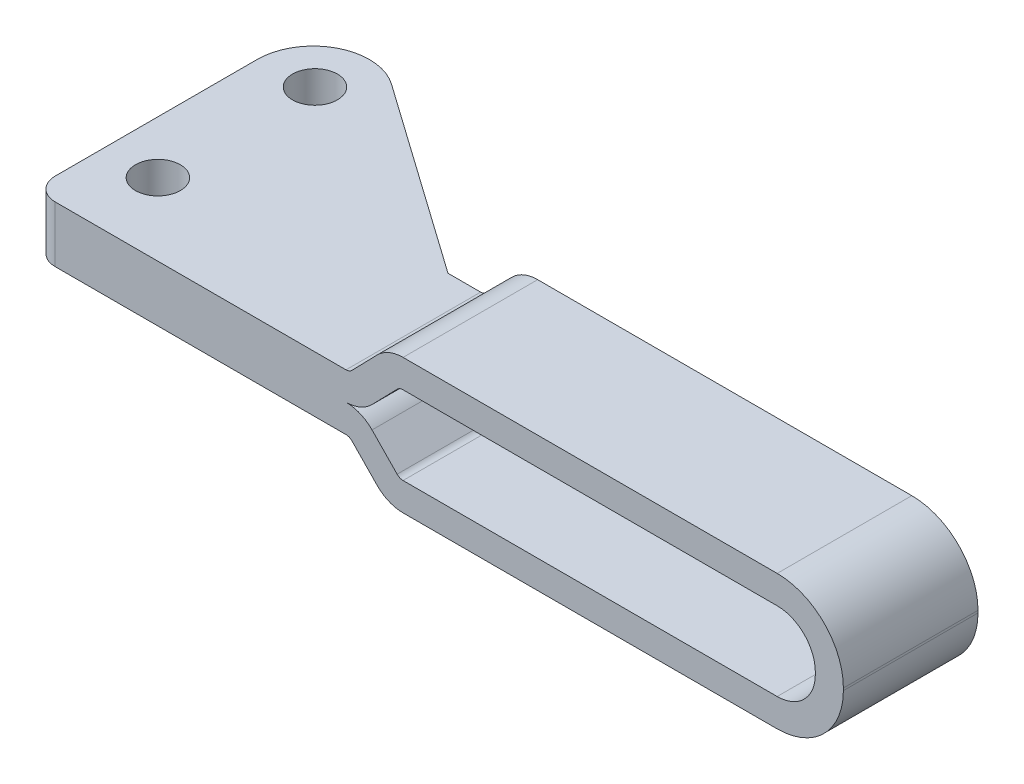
ISO-10303-21;
HEADER;
FILE_DESCRIPTION(('STEP AP214'),'2;1');
FILE_NAME('part.step','',(''),(''),'','','');
FILE_SCHEMA(('AUTOMOTIVE_DESIGN { 1 0 10303 214 1 1 1 1 }'));
ENDSEC;
DATA;
#1=APPLICATION_CONTEXT('core data for automotive mechanical design processes');
#2=APPLICATION_PROTOCOL_DEFINITION('international standard','automotive_design',2000,#1);
#3=PRODUCT_CONTEXT('',#1,'mechanical');
#4=PRODUCT('Part','Part','',(#3));
#5=PRODUCT_RELATED_PRODUCT_CATEGORY('part','',(#4));
#6=PRODUCT_DEFINITION_FORMATION('','',#4);
#7=PRODUCT_DEFINITION_CONTEXT('part definition',#1,'design');
#8=PRODUCT_DEFINITION('design','',#6,#7);
#9=PRODUCT_DEFINITION_SHAPE('','',#8);
#10=(LENGTH_UNIT() NAMED_UNIT(*) SI_UNIT(.MILLI.,.METRE.));
#11=(NAMED_UNIT(*) PLANE_ANGLE_UNIT() SI_UNIT($,.RADIAN.));
#12=(NAMED_UNIT(*) SI_UNIT($,.STERADIAN.) SOLID_ANGLE_UNIT());
#13=UNCERTAINTY_MEASURE_WITH_UNIT(LENGTH_MEASURE(1.E-05),#10,'distance_accuracy_value','');
#14=(GEOMETRIC_REPRESENTATION_CONTEXT(3) GLOBAL_UNCERTAINTY_ASSIGNED_CONTEXT((#13)) GLOBAL_UNIT_ASSIGNED_CONTEXT((#10,
#11,#12)) REPRESENTATION_CONTEXT('',''));
#15=CARTESIAN_POINT('',(0.,0.,0.));
#16=DIRECTION('',(0.,0.,1.));
#17=DIRECTION('',(1.,0.,0.));
#18=AXIS2_PLACEMENT_3D('',#15,#16,#17);
#19=CARTESIAN_POINT('',(0.,2.5,-14.));
#20=DIRECTION('',(0.,1.,0.));
#21=DIRECTION('',(-1.,0.,0.));
#22=AXIS2_PLACEMENT_3D('',#19,#20,#21);
#23=CYLINDRICAL_SURFACE('',#22,2.);
#24=CARTESIAN_POINT('',(0.,-2.49999999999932,-14.0000000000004));
#25=DIRECTION('',(0.,-1.,0.));
#26=DIRECTION('',(1.,0.,0.));
#27=AXIS2_PLACEMENT_3D('',#24,#25,#26);
#28=CIRCLE('',#27,2.);
#29=CARTESIAN_POINT('',(1.99999999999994,-2.49999999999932,-14.0000000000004));
#30=VERTEX_POINT('',#29);
#31=EDGE_CURVE('E299',#30,#30,#28,.T.);
#32=ORIENTED_EDGE('',*,*,#31,.T.);
#33=EDGE_LOOP('',(#32));
#34=FACE_BOUND('',#33,.T.);
#35=CARTESIAN_POINT('',(0.,2.5,-14.));
#36=DIRECTION('',(0.,1.,0.));
#37=DIRECTION('',(-1.,0.,0.));
#38=AXIS2_PLACEMENT_3D('',#35,#36,#37);
#39=CIRCLE('',#38,2.);
#40=CARTESIAN_POINT('',(-2.00000000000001,2.5,-14.));
#41=VERTEX_POINT('',#40);
#42=EDGE_CURVE('E9',#41,#41,#39,.T.);
#43=ORIENTED_EDGE('',*,*,#42,.T.);
#44=EDGE_LOOP('',(#43));
#45=FACE_BOUND('',#44,.T.);
#46=ADVANCED_FACE('F14',(#34,#45),#23,.F.);
#47=CARTESIAN_POINT('',(0.,2.5,0.));
#48=DIRECTION('',(0.,1.,0.));
#49=DIRECTION('',(-1.,0.,0.));
#50=AXIS2_PLACEMENT_3D('',#47,#48,#49);
#51=CYLINDRICAL_SURFACE('',#50,2.);
#52=CARTESIAN_POINT('',(0.,-2.49999999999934,-4.23272528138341E-13));
#53=DIRECTION('',(0.,-1.,0.));
#54=DIRECTION('',(1.,0.,0.));
#55=AXIS2_PLACEMENT_3D('',#52,#53,#54);
#56=CIRCLE('',#55,2.);
#57=CARTESIAN_POINT('',(1.99999999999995,-2.49999999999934,-4.26950575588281E-13));
#58=VERTEX_POINT('',#57);
#59=EDGE_CURVE('E300',#58,#58,#56,.T.);
#60=ORIENTED_EDGE('',*,*,#59,.T.);
#61=EDGE_LOOP('',(#60));
#62=FACE_BOUND('',#61,.T.);
#63=CARTESIAN_POINT('',(0.,2.5,0.));
#64=DIRECTION('',(0.,1.,0.));
#65=DIRECTION('',(-1.,0.,0.));
#66=AXIS2_PLACEMENT_3D('',#63,#64,#65);
#67=CIRCLE('',#66,2.);
#68=CARTESIAN_POINT('',(-1.99999999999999,2.5,0.));
#69=VERTEX_POINT('',#68);
#70=EDGE_CURVE('E25',#69,#69,#67,.T.);
#71=ORIENTED_EDGE('',*,*,#70,.T.);
#72=EDGE_LOOP('',(#71));
#73=FACE_BOUND('',#72,.T.);
#74=ADVANCED_FACE('F399',(#62,#73),#51,.F.);
#75=CARTESIAN_POINT('',(-3.99847823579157,6.0016353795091,4.45));
#76=DIRECTION('',(0.,1.,0.));
#77=DIRECTION('',(0.,0.,-1.));
#78=AXIS2_PLACEMENT_3D('',#75,#76,#77);
#79=PLANE('',#78);
#80=DIRECTION('',(1.,0.,0.));
#81=VECTOR('',#80,1.);
#82=CARTESIAN_POINT('',(69.0080963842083,6.00163537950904,6.44999999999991));
#83=LINE('',#82,#81);
#84=CARTESIAN_POINT('',(28.3021014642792,6.0016353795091,6.45));
#85=VERTEX_POINT('',#84);
#86=CARTESIAN_POINT('',(61.6500000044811,6.00163537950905,6.44999999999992));
#87=VERTEX_POINT('',#86);
#88=EDGE_CURVE('E554',#85,#87,#83,.T.);
#89=ORIENTED_EDGE('',*,*,#88,.T.);
#90=DIRECTION('',(0.,0.,-1.));
#91=VECTOR('',#90,1.);
#92=CARTESIAN_POINT('',(61.650000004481,6.00163537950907,4.44999999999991));
#93=LINE('',#92,#91);
#94=CARTESIAN_POINT('',(61.650000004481,6.00163537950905,-5.55000000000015));
#95=VERTEX_POINT('',#94);
#96=EDGE_CURVE('E39',#87,#95,#93,.T.);
#97=ORIENTED_EDGE('',*,*,#96,.T.);
#98=DIRECTION('',(-1.,0.,0.));
#99=VECTOR('',#98,1.);
#100=CARTESIAN_POINT('',(19.0080963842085,6.00163537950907,-5.55));
#101=LINE('',#100,#99);
#102=CARTESIAN_POINT('',(28.3021014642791,6.0016353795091,-5.55));
#103=VERTEX_POINT('',#102);
#104=EDGE_CURVE('E506',#95,#103,#101,.T.);
#105=ORIENTED_EDGE('',*,*,#104,.T.);
#106=DIRECTION('',(0.,0.,-1.));
#107=VECTOR('',#106,1.);
#108=CARTESIAN_POINT('',(28.3021014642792,6.00163537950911,4.44999999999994));
#109=LINE('',#108,#107);
#110=EDGE_CURVE('E500',#85,#103,#109,.T.);
#111=ORIENTED_EDGE('',*,*,#110,.F.);
#112=EDGE_LOOP('',(#89,#97,#105,#111));
#113=FACE_BOUND('',#112,.T.);
#114=ADVANCED_FACE('F374',(#113),#79,.T.);
#115=CARTESIAN_POINT('',(4.57001688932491,-16.9966869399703,4.44999999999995));
#116=DIRECTION('',(-0.716910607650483,0.697165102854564,0.));
#117=DIRECTION('',(0.,0.,-1.));
#118=AXIS2_PLACEMENT_3D('',#115,#116,#117);
#119=PLANE('',#118);
#120=DIRECTION('',(-0.697165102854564,-0.716910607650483,0.));
#121=VECTOR('',#120,1.);
#122=CARTESIAN_POINT('',(20.6093978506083,-0.503029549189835,-5.55));
#123=LINE('',#122,#121);
#124=CARTESIAN_POINT('',(25.9817485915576,5.02147995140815,-5.55));
#125=VERTEX_POINT('',#124);
#126=CARTESIAN_POINT('',(23.7466408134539,2.72306818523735,-5.55));
#127=VERTEX_POINT('',#126);
#128=EDGE_CURVE('E510',#125,#127,#123,.T.);
#129=ORIENTED_EDGE('',*,*,#128,.T.);
#130=DIRECTION('',(0.,0.,1.));
#131=VECTOR('',#130,1.);
#132=CARTESIAN_POINT('',(23.7466408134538,2.72306818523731,4.45));
#133=LINE('',#132,#131);
#134=CARTESIAN_POINT('',(23.7466408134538,2.72306818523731,6.45));
#135=VERTEX_POINT('',#134);
#136=EDGE_CURVE('E549',#127,#135,#133,.T.);
#137=ORIENTED_EDGE('',*,*,#136,.T.);
#138=DIRECTION('',(0.697165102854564,0.716910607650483,0.));
#139=VECTOR('',#138,1.);
#140=CARTESIAN_POINT('',(55.4676529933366,35.3425008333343,6.45));
#141=LINE('',#140,#139);
#142=CARTESIAN_POINT('',(25.9817485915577,5.0214799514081,6.45));
#143=VERTEX_POINT('',#142);
#144=EDGE_CURVE('E553',#135,#143,#141,.T.);
#145=ORIENTED_EDGE('',*,*,#144,.T.);
#146=DIRECTION('',(0.,0.,-1.));
#147=VECTOR('',#146,1.);
#148=CARTESIAN_POINT('',(25.9817485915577,5.02147995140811,4.44999999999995));
#149=LINE('',#148,#147);
#150=EDGE_CURVE('E557',#143,#125,#149,.T.);
#151=ORIENTED_EDGE('',*,*,#150,.T.);
#152=EDGE_LOOP('',(#129,#137,#145,#151));
#153=FACE_BOUND('',#152,.T.);
#154=ADVANCED_FACE('F370',(#153),#119,.T.);
#155=CARTESIAN_POINT('',(20.6093978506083,-0.503029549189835,-5.55));
#156=DIRECTION('',(0.,0.,1.));
#157=DIRECTION('',(-0.697165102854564,0.716910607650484,0.));
#158=AXIS2_PLACEMENT_3D('',#155,#156,#157);
#159=PLANE('',#158);
#160=CARTESIAN_POINT('',(61.650000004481,-0.101635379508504,-5.55000000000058));
#161=DIRECTION('',(0.,0.,-1.));
#162=DIRECTION('',(0.,-1.,0.));
#163=AXIS2_PLACEMENT_3D('',#160,#161,#162);
#164=CIRCLE('',#163,3.4);
#165=CARTESIAN_POINT('',(65.0500000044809,-0.101635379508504,-5.5500000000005));
#166=VERTEX_POINT('',#165);
#167=CARTESIAN_POINT('',(61.650000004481,-3.50163537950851,-5.55000000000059));
#168=VERTEX_POINT('',#167);
#169=EDGE_CURVE('E267',#166,#168,#164,.T.);
#170=ORIENTED_EDGE('',*,*,#169,.F.);
#171=DIRECTION('',(0.,1.,0.));
#172=VECTOR('',#171,1.);
#173=CARTESIAN_POINT('',(65.0500000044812,50.0477419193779,-5.55000000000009));
#174=LINE('',#173,#172);
#175=CARTESIAN_POINT('',(65.050000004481,0.101635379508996,-5.5500000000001));
#176=VERTEX_POINT('',#175);
#177=EDGE_CURVE('E304',#166,#176,#174,.T.);
#178=ORIENTED_EDGE('',*,*,#177,.T.);
#179=CARTESIAN_POINT('',(61.650000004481,0.101635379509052,-5.55000000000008));
#180=DIRECTION('',(0.,0.,1.));
#181=DIRECTION('',(-0.697165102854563,0.716910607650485,0.));
#182=AXIS2_PLACEMENT_3D('',#179,#180,#181);
#183=CIRCLE('',#182,3.4);
#184=CARTESIAN_POINT('',(61.650000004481,3.50163537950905,-5.55));
#185=VERTEX_POINT('',#184);
#186=EDGE_CURVE('E519',#176,#185,#183,.T.);
#187=ORIENTED_EDGE('',*,*,#186,.T.);
#188=DIRECTION('',(-1.,0.,0.));
#189=VECTOR('',#188,1.);
#190=CARTESIAN_POINT('',(19.0080963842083,3.50163537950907,-5.55000000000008));
#191=LINE('',#190,#189);
#192=CARTESIAN_POINT('',(28.3021014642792,3.50163537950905,-5.55000000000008));
#193=VERTEX_POINT('',#192);
#194=EDGE_CURVE('E499',#185,#193,#191,.T.);
#195=ORIENTED_EDGE('',*,*,#194,.T.);
#196=CARTESIAN_POINT('',(28.3021014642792,2.76503537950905,-5.55000000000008));
#197=DIRECTION('',(0.,0.,1.));
#198=DIRECTION('',(1.,0.,0.));
#199=AXIS2_PLACEMENT_3D('',#196,#197,#198);
#200=CIRCLE('',#199,0.7366);
#201=CARTESIAN_POINT('',(27.7740251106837,3.27856719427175,-5.55000000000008));
#202=VERTEX_POINT('',#201);
#203=EDGE_CURVE('E504',#193,#202,#200,.T.);
#204=ORIENTED_EDGE('',*,*,#203,.T.);
#205=DIRECTION('',(-0.697165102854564,-0.716910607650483,0.));
#206=VECTOR('',#205,1.);
#207=CARTESIAN_POINT('',(22.4016743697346,-2.24594230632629,-5.55));
#208=LINE('',#207,#206);
#209=CARTESIAN_POINT('',(25.5389173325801,0.980155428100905,-5.55));
#210=VERTEX_POINT('',#209);
#211=EDGE_CURVE('E534',#202,#210,#208,.T.);
#212=ORIENTED_EDGE('',*,*,#211,.T.);
#213=CARTESIAN_POINT('',(23.2185644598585,3.2366,-5.55));
#214=DIRECTION('',(0.,0.,-1.));
#215=DIRECTION('',(-0.697165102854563,0.716910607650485,0.));
#216=AXIS2_PLACEMENT_3D('',#213,#214,#215);
#217=CIRCLE('',#216,3.2366);
#218=CARTESIAN_POINT('',(23.2185644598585,0.,-5.55));
#219=VERTEX_POINT('',#218);
#220=EDGE_CURVE('E487',#210,#219,#217,.T.);
#221=ORIENTED_EDGE('',*,*,#220,.T.);
#222=CARTESIAN_POINT('',(23.2185644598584,-3.23659999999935,-5.55000000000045));
#223=DIRECTION('',(0.,0.,1.));
#224=DIRECTION('',(0.,1.,0.));
#225=AXIS2_PLACEMENT_3D('',#222,#223,#224);
#226=CIRCLE('',#225,3.2366);
#227=CARTESIAN_POINT('',(25.5389173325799,-0.980155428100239,-5.55000000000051));
#228=VERTEX_POINT('',#227);
#229=EDGE_CURVE('E291',#228,#219,#226,.T.);
#230=ORIENTED_EDGE('',*,*,#229,.F.);
#231=DIRECTION('',(-0.697165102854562,0.716910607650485,0.));
#232=VECTOR('',#231,1.);
#233=CARTESIAN_POINT('',(22.4016743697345,2.24594230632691,-5.5500000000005));
#234=LINE('',#233,#232);
#235=CARTESIAN_POINT('',(27.7740251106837,-3.27856719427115,-5.55000000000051));
#236=VERTEX_POINT('',#235);
#237=EDGE_CURVE('E257',#236,#228,#234,.T.);
#238=ORIENTED_EDGE('',*,*,#237,.F.);
#239=CARTESIAN_POINT('',(28.3021014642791,-2.76503537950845,-5.5500000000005));
#240=DIRECTION('',(0.,0.,-1.));
#241=DIRECTION('',(-0.697165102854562,0.716910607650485,0.));
#242=AXIS2_PLACEMENT_3D('',#239,#240,#241);
#243=CIRCLE('',#242,0.7366);
#244=CARTESIAN_POINT('',(28.3021014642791,-3.50163537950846,-5.55000000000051));
#245=VERTEX_POINT('',#244);
#246=EDGE_CURVE('E231',#245,#236,#243,.T.);
#247=ORIENTED_EDGE('',*,*,#246,.F.);
#248=DIRECTION('',(-1.,0.,0.));
#249=VECTOR('',#248,1.);
#250=CARTESIAN_POINT('',(19.0080963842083,-3.50163537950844,-5.55000000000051));
#251=LINE('',#250,#249);
#252=EDGE_CURVE('E631',#168,#245,#251,.T.);
#253=ORIENTED_EDGE('',*,*,#252,.F.);
#254=EDGE_LOOP('',(#170,#178,#187,#195,#204,#212,#221,#230,#238,#247,#253));
#255=FACE_BOUND('',#254,.T.);
#256=DIRECTION('',(0.,1.,0.));
#257=VECTOR('',#256,1.);
#258=CARTESIAN_POINT('',(67.5500000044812,50.0477419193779,-5.55));
#259=LINE('',#258,#257);
#260=CARTESIAN_POINT('',(67.5500000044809,-0.101635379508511,-5.55000000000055));
#261=VERTEX_POINT('',#260);
#262=CARTESIAN_POINT('',(67.5500000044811,0.101635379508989,-5.55000000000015));
#263=VERTEX_POINT('',#262);
#264=EDGE_CURVE('E572',#261,#263,#259,.T.);
#265=ORIENTED_EDGE('',*,*,#264,.F.);
#266=CARTESIAN_POINT('',(61.650000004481,-0.101635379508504,-5.55000000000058));
#267=DIRECTION('',(0.,0.,-1.));
#268=DIRECTION('',(0.,-1.,0.));
#269=AXIS2_PLACEMENT_3D('',#266,#267,#268);
#270=CIRCLE('',#269,5.9);
#271=CARTESIAN_POINT('',(61.650000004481,-6.0016353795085,-5.5500000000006));
#272=VERTEX_POINT('',#271);
#273=EDGE_CURVE('E275',#261,#272,#270,.T.);
#274=ORIENTED_EDGE('',*,*,#273,.T.);
#275=DIRECTION('',(-1.,0.,0.));
#276=VECTOR('',#275,1.);
#277=CARTESIAN_POINT('',(19.0080963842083,-6.00163537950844,-5.55000000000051));
#278=LINE('',#277,#276);
#279=CARTESIAN_POINT('',(28.3021014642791,-6.00163537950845,-5.55000000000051));
#280=VERTEX_POINT('',#279);
#281=EDGE_CURVE('E243',#272,#280,#278,.T.);
#282=ORIENTED_EDGE('',*,*,#281,.T.);
#283=CARTESIAN_POINT('',(28.3021014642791,-2.76503537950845,-5.5500000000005));
#284=DIRECTION('',(0.,0.,-1.));
#285=DIRECTION('',(-0.697165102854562,0.716910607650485,0.));
#286=AXIS2_PLACEMENT_3D('',#283,#284,#285);
#287=CIRCLE('',#286,3.2366);
#288=CARTESIAN_POINT('',(25.9817485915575,-5.02147995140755,-5.55000000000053));
#289=VERTEX_POINT('',#288);
#290=EDGE_CURVE('E227',#280,#289,#287,.T.);
#291=ORIENTED_EDGE('',*,*,#290,.T.);
#292=DIRECTION('',(-0.697165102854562,0.716910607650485,0.));
#293=VECTOR('',#292,1.);
#294=CARTESIAN_POINT('',(20.6093978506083,0.503029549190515,-5.55000000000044));
#295=LINE('',#294,#293);
#296=CARTESIAN_POINT('',(23.7466408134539,-2.7230681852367,-5.55000000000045));
#297=VERTEX_POINT('',#296);
#298=EDGE_CURVE('E635',#289,#297,#295,.T.);
#299=ORIENTED_EDGE('',*,*,#298,.T.);
#300=CARTESIAN_POINT('',(23.2185644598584,-3.23659999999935,-5.55000000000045));
#301=DIRECTION('',(0.,0.,1.));
#302=DIRECTION('',(0.,-1.,0.));
#303=AXIS2_PLACEMENT_3D('',#300,#301,#302);
#304=CIRCLE('',#303,0.7366);
#305=CARTESIAN_POINT('',(23.2185644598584,-2.49999999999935,-5.55000000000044));
#306=VERTEX_POINT('',#305);
#307=EDGE_CURVE('E618',#297,#306,#304,.T.);
#308=ORIENTED_EDGE('',*,*,#307,.T.);
#309=DIRECTION('',(-1.,0.,0.));
#310=VECTOR('',#309,1.);
#311=CARTESIAN_POINT('',(20.30657462,-2.49999999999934,-5.55000000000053));
#312=LINE('',#311,#310);
#313=CARTESIAN_POINT('',(20.30657462,-2.49999999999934,-5.55000000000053));
#314=VERTEX_POINT('',#313);
#315=EDGE_CURVE('E286',#306,#314,#312,.T.);
#316=ORIENTED_EDGE('',*,*,#315,.T.);
#317=DIRECTION('',(0.,-1.,0.));
#318=VECTOR('',#317,1.);
#319=CARTESIAN_POINT('',(20.30657462,2.49999999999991,-5.55));
#320=LINE('',#319,#318);
#321=CARTESIAN_POINT('',(20.30657462,2.49999999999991,-5.55));
#322=VERTEX_POINT('',#321);
#323=EDGE_CURVE('E457',#322,#314,#320,.T.);
#324=ORIENTED_EDGE('',*,*,#323,.F.);
#325=DIRECTION('',(-1.,0.,0.));
#326=VECTOR('',#325,1.);
#327=CARTESIAN_POINT('',(20.30657462,2.49999999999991,-5.55));
#328=LINE('',#327,#326);
#329=CARTESIAN_POINT('',(23.2185644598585,2.49999999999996,-5.55));
#330=VERTEX_POINT('',#329);
#331=EDGE_CURVE('E474',#330,#322,#328,.T.);
#332=ORIENTED_EDGE('',*,*,#331,.F.);
#333=CARTESIAN_POINT('',(23.2185644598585,3.2366,-5.55));
#334=DIRECTION('',(0.,0.,-1.));
#335=DIRECTION('',(-0.716910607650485,-0.697165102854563,0.));
#336=AXIS2_PLACEMENT_3D('',#333,#334,#335);
#337=CIRCLE('',#336,0.736599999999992);
#338=EDGE_CURVE('E566',#127,#330,#337,.T.);
#339=ORIENTED_EDGE('',*,*,#338,.F.);
#340=ORIENTED_EDGE('',*,*,#128,.F.);
#341=CARTESIAN_POINT('',(28.3021014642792,2.76503537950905,-5.55000000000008));
#342=DIRECTION('',(0.,0.,1.));
#343=DIRECTION('',(1.,0.,0.));
#344=AXIS2_PLACEMENT_3D('',#341,#342,#343);
#345=CIRCLE('',#344,3.2366);
#346=EDGE_CURVE('E505',#103,#125,#345,.T.);
#347=ORIENTED_EDGE('',*,*,#346,.F.);
#348=ORIENTED_EDGE('',*,*,#104,.F.);
#349=CARTESIAN_POINT('',(61.650000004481,0.101635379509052,-5.55000000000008));
#350=DIRECTION('',(0.,0.,1.));
#351=DIRECTION('',(0.697165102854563,-0.716910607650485,0.));
#352=AXIS2_PLACEMENT_3D('',#349,#350,#351);
#353=CIRCLE('',#352,5.9);
#354=EDGE_CURVE('E547',#263,#95,#353,.T.);
#355=ORIENTED_EDGE('',*,*,#354,.F.);
#356=EDGE_LOOP('',(#265,#274,#282,#291,#299,#308,#316,#324,#332,#339,#340,#347,#348,#355));
#357=FACE_BOUND('',#356,.T.);
#358=ADVANCED_FACE('F373',(#255,#357),#159,.F.);
#359=CARTESIAN_POINT('',(55.4676529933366,35.3425008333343,6.45));
#360=DIRECTION('',(0.,0.,-1.));
#361=DIRECTION('',(0.697165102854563,-0.716910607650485,0.));
#362=AXIS2_PLACEMENT_3D('',#359,#360,#361);
#363=PLANE('',#362);
#364=DIRECTION('',(0.,-1.,0.));
#365=VECTOR('',#364,1.);
#366=CARTESIAN_POINT('',(65.050000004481,0.0477419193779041,6.44999999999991));
#367=LINE('',#366,#365);
#368=CARTESIAN_POINT('',(65.050000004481,0.101635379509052,6.44999999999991));
#369=VERTEX_POINT('',#368);
#370=CARTESIAN_POINT('',(65.050000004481,-0.101635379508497,6.44999999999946));
#371=VERTEX_POINT('',#370);
#372=EDGE_CURVE('E524',#369,#371,#367,.T.);
#373=ORIENTED_EDGE('',*,*,#372,.T.);
#374=CARTESIAN_POINT('',(61.650000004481,-0.101635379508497,6.44999999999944));
#375=DIRECTION('',(0.,0.,1.));
#376=DIRECTION('',(0.,1.,0.));
#377=AXIS2_PLACEMENT_3D('',#374,#375,#376);
#378=CIRCLE('',#377,3.4);
#379=CARTESIAN_POINT('',(61.650000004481,-3.5016353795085,6.44999999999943));
#380=VERTEX_POINT('',#379);
#381=EDGE_CURVE('E616',#380,#371,#378,.T.);
#382=ORIENTED_EDGE('',*,*,#381,.F.);
#383=DIRECTION('',(1.,0.,0.));
#384=VECTOR('',#383,1.);
#385=CARTESIAN_POINT('',(69.0080963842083,-3.50163537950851,6.44999999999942));
#386=LINE('',#385,#384);
#387=CARTESIAN_POINT('',(28.3021014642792,-3.50163537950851,6.44999999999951));
#388=VERTEX_POINT('',#387);
#389=EDGE_CURVE('E603',#388,#380,#386,.T.);
#390=ORIENTED_EDGE('',*,*,#389,.F.);
#391=CARTESIAN_POINT('',(28.3021014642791,-2.7650353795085,6.44999999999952));
#392=DIRECTION('',(0.,0.,1.));
#393=DIRECTION('',(0.716910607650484,0.697165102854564,0.));
#394=AXIS2_PLACEMENT_3D('',#391,#392,#393);
#395=CIRCLE('',#394,0.7366);
#396=CARTESIAN_POINT('',(27.7740251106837,-3.27856719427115,6.44999999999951));
#397=VERTEX_POINT('',#396);
#398=EDGE_CURVE('E259',#397,#388,#395,.T.);
#399=ORIENTED_EDGE('',*,*,#398,.F.);
#400=DIRECTION('',(0.697165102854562,-0.716910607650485,0.));
#401=VECTOR('',#400,1.);
#402=CARTESIAN_POINT('',(57.2599295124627,-33.5995880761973,6.44999999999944));
#403=LINE('',#402,#401);
#404=CARTESIAN_POINT('',(25.53891733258,-0.980155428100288,6.4499999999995));
#405=VERTEX_POINT('',#404);
#406=EDGE_CURVE('E18',#405,#397,#403,.T.);
#407=ORIENTED_EDGE('',*,*,#406,.F.);
#408=CARTESIAN_POINT('',(23.2185644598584,-3.23659999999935,6.44999999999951));
#409=DIRECTION('',(0.,0.,-1.));
#410=DIRECTION('',(0.,-1.,0.));
#411=AXIS2_PLACEMENT_3D('',#408,#409,#410);
#412=CIRCLE('',#411,3.2366);
#413=CARTESIAN_POINT('',(23.2185644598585,0.,6.45));
#414=VERTEX_POINT('',#413);
#415=EDGE_CURVE('E287',#414,#405,#412,.T.);
#416=ORIENTED_EDGE('',*,*,#415,.F.);
#417=CARTESIAN_POINT('',(23.2185644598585,3.23659999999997,6.45));
#418=DIRECTION('',(0.,0.,1.));
#419=DIRECTION('',(-0.697165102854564,0.716910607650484,0.));
#420=AXIS2_PLACEMENT_3D('',#417,#418,#419);
#421=CIRCLE('',#420,3.2366);
#422=CARTESIAN_POINT('',(25.5389173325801,0.980155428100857,6.45));
#423=VERTEX_POINT('',#422);
#424=EDGE_CURVE('E485',#414,#423,#421,.T.);
#425=ORIENTED_EDGE('',*,*,#424,.T.);
#426=DIRECTION('',(0.697165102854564,0.716910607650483,0.));
#427=VECTOR('',#426,1.);
#428=CARTESIAN_POINT('',(57.2599295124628,33.5995880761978,6.44999999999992));
#429=LINE('',#428,#427);
#430=CARTESIAN_POINT('',(27.7740251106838,3.27856719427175,6.44999999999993));
#431=VERTEX_POINT('',#430);
#432=EDGE_CURVE('E530',#423,#431,#429,.T.);
#433=ORIENTED_EDGE('',*,*,#432,.T.);
#434=CARTESIAN_POINT('',(28.3021014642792,2.76503537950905,6.45));
#435=DIRECTION('',(0.,0.,-1.));
#436=DIRECTION('',(1.,0.,0.));
#437=AXIS2_PLACEMENT_3D('',#434,#435,#436);
#438=CIRCLE('',#437,0.7366);
#439=CARTESIAN_POINT('',(28.3021014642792,3.50163537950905,6.45));
#440=VERTEX_POINT('',#439);
#441=EDGE_CURVE('E483',#431,#440,#438,.T.);
#442=ORIENTED_EDGE('',*,*,#441,.T.);
#443=DIRECTION('',(1.,0.,0.));
#444=VECTOR('',#443,1.);
#445=CARTESIAN_POINT('',(69.0080963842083,3.50163537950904,6.4499999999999));
#446=LINE('',#445,#444);
#447=CARTESIAN_POINT('',(61.6500000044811,3.50163537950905,6.44999999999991));
#448=VERTEX_POINT('',#447);
#449=EDGE_CURVE('E498',#440,#448,#446,.T.);
#450=ORIENTED_EDGE('',*,*,#449,.T.);
#451=CARTESIAN_POINT('',(61.6500000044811,0.101635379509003,6.44999999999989));
#452=DIRECTION('',(0.,0.,-1.));
#453=DIRECTION('',(-0.697165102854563,0.716910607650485,0.));
#454=AXIS2_PLACEMENT_3D('',#451,#452,#453);
#455=CIRCLE('',#454,3.4);
#456=EDGE_CURVE('E515',#448,#369,#455,.T.);
#457=ORIENTED_EDGE('',*,*,#456,.T.);
#458=EDGE_LOOP('',(#373,#382,#390,#399,#407,#416,#425,#433,#442,#450,#457));
#459=FACE_BOUND('',#458,.T.);
#460=ORIENTED_EDGE('',*,*,#144,.F.);
#461=CARTESIAN_POINT('',(23.2185644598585,3.23659999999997,6.45));
#462=DIRECTION('',(0.,0.,1.));
#463=DIRECTION('',(0.716910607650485,0.697165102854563,0.));
#464=AXIS2_PLACEMENT_3D('',#461,#462,#463);
#465=CIRCLE('',#464,0.7366);
#466=CARTESIAN_POINT('',(23.2185644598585,2.49999999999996,6.45));
#467=VERTEX_POINT('',#466);
#468=EDGE_CURVE('E543',#467,#135,#465,.T.);
#469=ORIENTED_EDGE('',*,*,#468,.F.);
#470=DIRECTION('',(1.,0.,0.));
#471=VECTOR('',#470,1.);
#472=CARTESIAN_POINT('',(70.30657462,2.49999999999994,6.44999999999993));
#473=LINE('',#472,#471);
#474=CARTESIAN_POINT('',(-2.69999999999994,2.5,6.45));
#475=VERTEX_POINT('',#474);
#476=EDGE_CURVE('E540',#475,#467,#473,.T.);
#477=ORIENTED_EDGE('',*,*,#476,.F.);
#478=DIRECTION('',(0.,-1.,0.));
#479=VECTOR('',#478,1.);
#480=CARTESIAN_POINT('',(-2.69999999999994,2.5,6.45));
#481=LINE('',#480,#479);
#482=CARTESIAN_POINT('',(-2.70000000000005,-2.49999999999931,6.44999999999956));
#483=VERTEX_POINT('',#482);
#484=EDGE_CURVE('E591',#475,#483,#481,.T.);
#485=ORIENTED_EDGE('',*,*,#484,.T.);
#486=DIRECTION('',(1.,0.,0.));
#487=VECTOR('',#486,1.);
#488=CARTESIAN_POINT('',(70.30657462,-2.4999999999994,6.44999999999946));
#489=LINE('',#488,#487);
#490=CARTESIAN_POINT('',(23.2185644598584,-2.49999999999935,6.44999999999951));
#491=VERTEX_POINT('',#490);
#492=EDGE_CURVE('E630',#483,#491,#489,.T.);
#493=ORIENTED_EDGE('',*,*,#492,.T.);
#494=CARTESIAN_POINT('',(23.2185644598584,-3.23659999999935,6.44999999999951));
#495=DIRECTION('',(0.,0.,-1.));
#496=DIRECTION('',(0.,-1.,0.));
#497=AXIS2_PLACEMENT_3D('',#494,#495,#496);
#498=CIRCLE('',#497,0.7366);
#499=CARTESIAN_POINT('',(23.7466408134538,-2.72306818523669,6.44999999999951));
#500=VERTEX_POINT('',#499);
#501=EDGE_CURVE('E622',#491,#500,#498,.T.);
#502=ORIENTED_EDGE('',*,*,#501,.T.);
#503=DIRECTION('',(0.697165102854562,-0.716910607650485,0.));
#504=VECTOR('',#503,1.);
#505=CARTESIAN_POINT('',(55.4676529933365,-35.3425008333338,6.4499999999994));
#506=LINE('',#505,#504);
#507=CARTESIAN_POINT('',(25.9817485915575,-5.02147995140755,6.44999999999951));
#508=VERTEX_POINT('',#507);
#509=EDGE_CURVE('E250',#500,#508,#506,.T.);
#510=ORIENTED_EDGE('',*,*,#509,.T.);
#511=CARTESIAN_POINT('',(28.3021014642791,-2.7650353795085,6.44999999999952));
#512=DIRECTION('',(0.,0.,1.));
#513=DIRECTION('',(-0.697165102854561,0.716910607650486,0.));
#514=AXIS2_PLACEMENT_3D('',#511,#512,#513);
#515=CIRCLE('',#514,3.2366);
#516=CARTESIAN_POINT('',(28.3021014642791,-6.0016353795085,6.44999999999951));
#517=VERTEX_POINT('',#516);
#518=EDGE_CURVE('E225',#508,#517,#515,.T.);
#519=ORIENTED_EDGE('',*,*,#518,.T.);
#520=DIRECTION('',(1.,0.,0.));
#521=VECTOR('',#520,1.);
#522=CARTESIAN_POINT('',(69.0080963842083,-6.00163537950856,6.44999999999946));
#523=LINE('',#522,#521);
#524=CARTESIAN_POINT('',(61.6500000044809,-6.00163537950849,6.44999999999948));
#525=VERTEX_POINT('',#524);
#526=EDGE_CURVE('E235',#517,#525,#523,.T.);
#527=ORIENTED_EDGE('',*,*,#526,.T.);
#528=CARTESIAN_POINT('',(61.650000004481,-0.101635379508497,6.44999999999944));
#529=DIRECTION('',(0.,0.,1.));
#530=DIRECTION('',(0.,-1.,0.));
#531=AXIS2_PLACEMENT_3D('',#528,#529,#530);
#532=CIRCLE('',#531,5.9);
#533=CARTESIAN_POINT('',(67.550000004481,-0.101635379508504,6.44999999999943));
#534=VERTEX_POINT('',#533);
#535=EDGE_CURVE('E273',#525,#534,#532,.T.);
#536=ORIENTED_EDGE('',*,*,#535,.T.);
#537=DIRECTION('',(0.,-1.,0.));
#538=VECTOR('',#537,1.);
#539=CARTESIAN_POINT('',(67.550000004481,0.0477419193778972,6.44999999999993));
#540=LINE('',#539,#538);
#541=CARTESIAN_POINT('',(67.550000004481,0.101635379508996,6.44999999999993));
#542=VERTEX_POINT('',#541);
#543=EDGE_CURVE('E573',#542,#534,#540,.T.);
#544=ORIENTED_EDGE('',*,*,#543,.F.);
#545=CARTESIAN_POINT('',(61.6500000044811,0.101635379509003,6.44999999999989));
#546=DIRECTION('',(0.,0.,-1.));
#547=DIRECTION('',(-0.697165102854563,0.716910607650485,0.));
#548=AXIS2_PLACEMENT_3D('',#545,#546,#547);
#549=CIRCLE('',#548,5.9);
#550=EDGE_CURVE('E544',#87,#542,#549,.T.);
#551=ORIENTED_EDGE('',*,*,#550,.F.);
#552=ORIENTED_EDGE('',*,*,#88,.F.);
#553=CARTESIAN_POINT('',(28.3021014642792,2.76503537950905,6.45));
#554=DIRECTION('',(0.,0.,-1.));
#555=DIRECTION('',(0.,-1.,0.));
#556=AXIS2_PLACEMENT_3D('',#553,#554,#555);
#557=CIRCLE('',#556,3.2366);
#558=EDGE_CURVE('E514',#143,#85,#557,.T.);
#559=ORIENTED_EDGE('',*,*,#558,.F.);
#560=EDGE_LOOP('',(#460,#469,#477,#485,#493,#502,#510,#519,#527,#536,#544,#551,#552,#559));
#561=FACE_BOUND('',#560,.T.);
#562=ADVANCED_FACE('F247',(#459,#561),#363,.F.);
#563=CARTESIAN_POINT('',(6.36229340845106,-18.7395996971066,4.45));
#564=DIRECTION('',(-0.716910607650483,0.697165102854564,0.));
#565=DIRECTION('',(0.,0.,-1.));
#566=AXIS2_PLACEMENT_3D('',#563,#564,#565);
#567=PLANE('',#566);
#568=DIRECTION('',(0.,0.,1.));
#569=VECTOR('',#568,1.);
#570=CARTESIAN_POINT('',(25.5389173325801,0.980155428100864,4.44999999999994));
#571=LINE('',#570,#569);
#572=EDGE_CURVE('E518',#210,#423,#571,.T.);
#573=ORIENTED_EDGE('',*,*,#572,.F.);
#574=ORIENTED_EDGE('',*,*,#211,.F.);
#575=DIRECTION('',(0.,0.,-1.));
#576=VECTOR('',#575,1.);
#577=CARTESIAN_POINT('',(27.7740251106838,3.27856719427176,4.44999999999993));
#578=LINE('',#577,#576);
#579=EDGE_CURVE('E493',#431,#202,#578,.T.);
#580=ORIENTED_EDGE('',*,*,#579,.F.);
#581=ORIENTED_EDGE('',*,*,#432,.F.);
#582=EDGE_LOOP('',(#573,#574,#580,#581));
#583=FACE_BOUND('',#582,.T.);
#584=ADVANCED_FACE('F376',(#583),#567,.F.);
#585=CARTESIAN_POINT('',(-3.99847823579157,3.5016353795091,4.45));
#586=DIRECTION('',(0.,1.,0.));
#587=DIRECTION('',(0.,0.,-1.));
#588=AXIS2_PLACEMENT_3D('',#585,#586,#587);
#589=PLANE('',#588);
#590=DIRECTION('',(0.,0.,-1.));
#591=VECTOR('',#590,1.);
#592=CARTESIAN_POINT('',(61.650000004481,3.50163537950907,4.44999999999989));
#593=LINE('',#592,#591);
#594=EDGE_CURVE('E548',#448,#185,#593,.T.);
#595=ORIENTED_EDGE('',*,*,#594,.F.);
#596=ORIENTED_EDGE('',*,*,#449,.F.);
#597=DIRECTION('',(0.,0.,-1.));
#598=VECTOR('',#597,1.);
#599=CARTESIAN_POINT('',(28.3021014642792,3.50163537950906,4.44999999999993));
#600=LINE('',#599,#598);
#601=EDGE_CURVE('E494',#440,#193,#600,.T.);
#602=ORIENTED_EDGE('',*,*,#601,.T.);
#603=ORIENTED_EDGE('',*,*,#194,.F.);
#604=EDGE_LOOP('',(#595,#596,#602,#603));
#605=FACE_BOUND('',#604,.T.);
#606=ADVANCED_FACE('F379',(#605),#589,.F.);
#607=CARTESIAN_POINT('',(28.3021014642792,2.76503537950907,-11.9100880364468));
#608=DIRECTION('',(0.,0.,1.));
#609=DIRECTION('',(1.,0.,0.));
#610=AXIS2_PLACEMENT_3D('',#607,#608,#609);
#611=CYLINDRICAL_SURFACE('',#610,3.2366);
#612=ORIENTED_EDGE('',*,*,#110,.T.);
#613=ORIENTED_EDGE('',*,*,#346,.T.);
#614=ORIENTED_EDGE('',*,*,#150,.F.);
#615=ORIENTED_EDGE('',*,*,#558,.T.);
#616=EDGE_LOOP('',(#612,#613,#614,#615));
#617=FACE_BOUND('',#616,.T.);
#618=ADVANCED_FACE('F383',(#617),#611,.T.);
#619=CARTESIAN_POINT('',(28.3021014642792,2.76503537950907,-11.9100880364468));
#620=DIRECTION('',(0.,0.,1.));
#621=DIRECTION('',(1.,0.,0.));
#622=AXIS2_PLACEMENT_3D('',#619,#620,#621);
#623=CYLINDRICAL_SURFACE('',#622,0.7366);
#624=ORIENTED_EDGE('',*,*,#601,.F.);
#625=ORIENTED_EDGE('',*,*,#441,.F.);
#626=ORIENTED_EDGE('',*,*,#579,.T.);
#627=ORIENTED_EDGE('',*,*,#203,.F.);
#628=EDGE_LOOP('',(#624,#625,#626,#627));
#629=FACE_BOUND('',#628,.T.);
#630=ADVANCED_FACE('F395',(#629),#623,.F.);
#631=CARTESIAN_POINT('',(-2.7,2.5,4.45));
#632=DIRECTION('',(0.,-1.,0.));
#633=DIRECTION('',(1.,0.,0.));
#634=AXIS2_PLACEMENT_3D('',#631,#632,#633);
#635=CYLINDRICAL_SURFACE('',#634,2.);
#636=DIRECTION('',(0.,-1.,0.));
#637=VECTOR('',#636,1.);
#638=CARTESIAN_POINT('',(-4.7,2.50000000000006,4.45));
#639=LINE('',#638,#637);
#640=CARTESIAN_POINT('',(-4.7,2.50000000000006,4.45));
#641=VERTEX_POINT('',#640);
#642=CARTESIAN_POINT('',(-4.7,-2.49999999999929,4.44999999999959));
#643=VERTEX_POINT('',#642);
#644=EDGE_CURVE('E490',#641,#643,#639,.T.);
#645=ORIENTED_EDGE('',*,*,#644,.T.);
#646=CARTESIAN_POINT('',(-2.7,-2.4999999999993,4.44999999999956));
#647=DIRECTION('',(0.,1.,0.));
#648=DIRECTION('',(-1.,0.,0.));
#649=AXIS2_PLACEMENT_3D('',#646,#647,#648);
#650=CIRCLE('',#649,2.);
#651=EDGE_CURVE('E232',#643,#483,#650,.T.);
#652=ORIENTED_EDGE('',*,*,#651,.T.);
#653=ORIENTED_EDGE('',*,*,#484,.F.);
#654=CARTESIAN_POINT('',(-2.7,2.5,4.45));
#655=DIRECTION('',(0.,1.,0.));
#656=DIRECTION('',(-1.,0.,0.));
#657=AXIS2_PLACEMENT_3D('',#654,#655,#656);
#658=CIRCLE('',#657,2.);
#659=EDGE_CURVE('E535',#641,#475,#658,.T.);
#660=ORIENTED_EDGE('',*,*,#659,.F.);
#661=EDGE_LOOP('',(#645,#652,#653,#660));
#662=FACE_BOUND('',#661,.T.);
#663=ADVANCED_FACE('F391',(#662),#635,.T.);
#664=CARTESIAN_POINT('',(-4.7,2.50000000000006,4.45));
#665=DIRECTION('',(1.,0.,0.));
#666=DIRECTION('',(0.,0.,1.));
#667=AXIS2_PLACEMENT_3D('',#664,#665,#666);
#668=PLANE('',#667);
#669=DIRECTION('',(0.,-1.,0.));
#670=VECTOR('',#669,1.);
#671=CARTESIAN_POINT('',(-4.7,2.5,-13.55));
#672=LINE('',#671,#670);
#673=CARTESIAN_POINT('',(-4.7,2.5,-13.55));
#674=VERTEX_POINT('',#673);
#675=CARTESIAN_POINT('',(-4.70000000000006,-2.49999999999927,-13.5500000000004));
#676=VERTEX_POINT('',#675);
#677=EDGE_CURVE('E456',#674,#676,#672,.T.);
#678=ORIENTED_EDGE('',*,*,#677,.T.);
#679=DIRECTION('',(0.,0.,1.));
#680=VECTOR('',#679,1.);
#681=CARTESIAN_POINT('',(-4.7,-2.49999999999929,4.44999999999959));
#682=LINE('',#681,#680);
#683=EDGE_CURVE('E272',#676,#643,#682,.T.);
#684=ORIENTED_EDGE('',*,*,#683,.T.);
#685=ORIENTED_EDGE('',*,*,#644,.F.);
#686=DIRECTION('',(0.,0.,1.));
#687=VECTOR('',#686,1.);
#688=CARTESIAN_POINT('',(-4.7,2.50000000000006,4.45));
#689=LINE('',#688,#687);
#690=EDGE_CURVE('E539',#674,#641,#689,.T.);
#691=ORIENTED_EDGE('',*,*,#690,.F.);
#692=EDGE_LOOP('',(#678,#684,#685,#691));
#693=FACE_BOUND('',#692,.T.);
#694=ADVANCED_FACE('F394',(#693),#668,.F.);
#695=CARTESIAN_POINT('',(0.300000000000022,2.49999999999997,-13.55));
#696=DIRECTION('',(0.,-1.,0.));
#697=DIRECTION('',(1.,0.,0.));
#698=AXIS2_PLACEMENT_3D('',#695,#696,#697);
#699=CYLINDRICAL_SURFACE('',#698,5.);
#700=DIRECTION('',(0.,-1.,0.));
#701=VECTOR('',#700,1.);
#702=CARTESIAN_POINT('',(3.1830822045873,2.5,-17.6350749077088));
#703=LINE('',#702,#701);
#704=CARTESIAN_POINT('',(3.1830822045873,2.5,-17.6350749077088));
#705=VERTEX_POINT('',#704);
#706=CARTESIAN_POINT('',(3.18308220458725,-2.49999999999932,-17.6350749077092));
#707=VERTEX_POINT('',#706);
#708=EDGE_CURVE('E448',#705,#707,#703,.T.);
#709=ORIENTED_EDGE('',*,*,#708,.T.);
#710=CARTESIAN_POINT('',(0.299999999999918,-2.49999999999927,-13.5500000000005));
#711=DIRECTION('',(0.,1.,0.));
#712=DIRECTION('',(1.,0.,0.));
#713=AXIS2_PLACEMENT_3D('',#710,#711,#712);
#714=CIRCLE('',#713,5.);
#715=EDGE_CURVE('E285',#707,#676,#714,.T.);
#716=ORIENTED_EDGE('',*,*,#715,.T.);
#717=ORIENTED_EDGE('',*,*,#677,.F.);
#718=CARTESIAN_POINT('',(0.300000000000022,2.49999999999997,-13.55));
#719=DIRECTION('',(0.,1.,0.));
#720=DIRECTION('',(1.,0.,0.));
#721=AXIS2_PLACEMENT_3D('',#718,#719,#720);
#722=CIRCLE('',#721,5.);
#723=EDGE_CURVE('E452',#705,#674,#722,.T.);
#724=ORIENTED_EDGE('',*,*,#723,.F.);
#725=EDGE_LOOP('',(#709,#716,#717,#724));
#726=FACE_BOUND('',#725,.T.);
#727=ADVANCED_FACE('F408',(#726),#699,.T.);
#728=CARTESIAN_POINT('',(3.1830822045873,2.5,-17.6350749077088));
#729=DIRECTION('',(-0.576616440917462,0.,0.817014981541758));
#730=DIRECTION('',(0.,-1.,0.));
#731=AXIS2_PLACEMENT_3D('',#728,#729,#730);
#732=PLANE('',#731);
#733=ORIENTED_EDGE('',*,*,#323,.T.);
#734=DIRECTION('',(-0.817014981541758,0.,-0.576616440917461));
#735=VECTOR('',#734,1.);
#736=CARTESIAN_POINT('',(3.18308220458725,-2.49999999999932,-17.6350749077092));
#737=LINE('',#736,#735);
#738=EDGE_CURVE('E281',#314,#707,#737,.T.);
#739=ORIENTED_EDGE('',*,*,#738,.T.);
#740=ORIENTED_EDGE('',*,*,#708,.F.);
#741=DIRECTION('',(-0.817014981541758,0.,-0.576616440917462));
#742=VECTOR('',#741,1.);
#743=CARTESIAN_POINT('',(3.1830822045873,2.5,-17.6350749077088));
#744=LINE('',#743,#742);
#745=EDGE_CURVE('E468',#322,#705,#744,.T.);
#746=ORIENTED_EDGE('',*,*,#745,.F.);
#747=EDGE_LOOP('',(#733,#739,#740,#746));
#748=FACE_BOUND('',#747,.T.);
#749=ADVANCED_FACE('F415',(#748),#732,.F.);
#750=CARTESIAN_POINT('',(-2.7,2.5,4.45));
#751=DIRECTION('',(0.,1.,0.));
#752=DIRECTION('',(0.,0.,-1.));
#753=AXIS2_PLACEMENT_3D('',#750,#751,#752);
#754=PLANE('',#753);
#755=DIRECTION('',(0.,0.,1.));
#756=VECTOR('',#755,1.);
#757=CARTESIAN_POINT('',(23.2185644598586,2.49999999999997,4.45));
#758=LINE('',#757,#756);
#759=EDGE_CURVE('E488',#330,#467,#758,.T.);
#760=ORIENTED_EDGE('',*,*,#759,.F.);
#761=ORIENTED_EDGE('',*,*,#331,.T.);
#762=ORIENTED_EDGE('',*,*,#745,.T.);
#763=ORIENTED_EDGE('',*,*,#723,.T.);
#764=ORIENTED_EDGE('',*,*,#690,.T.);
#765=ORIENTED_EDGE('',*,*,#659,.T.);
#766=ORIENTED_EDGE('',*,*,#476,.T.);
#767=EDGE_LOOP('',(#760,#761,#762,#763,#764,#765,#766));
#768=FACE_BOUND('',#767,.T.);
#769=ORIENTED_EDGE('',*,*,#42,.F.);
#770=EDGE_LOOP('',(#769));
#771=FACE_BOUND('',#770,.T.);
#772=ORIENTED_EDGE('',*,*,#70,.F.);
#773=EDGE_LOOP('',(#772));
#774=FACE_BOUND('',#773,.T.);
#775=ADVANCED_FACE('F389',(#768,#771,#774),#754,.T.);
#776=CARTESIAN_POINT('',(23.2185644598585,3.2366,13.1270947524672));
#777=DIRECTION('',(0.,0.,-1.));
#778=DIRECTION('',(-0.697165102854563,0.716910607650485,0.));
#779=AXIS2_PLACEMENT_3D('',#776,#777,#778);
#780=CYLINDRICAL_SURFACE('',#779,0.7366);
#781=ORIENTED_EDGE('',*,*,#759,.T.);
#782=ORIENTED_EDGE('',*,*,#468,.T.);
#783=ORIENTED_EDGE('',*,*,#136,.F.);
#784=ORIENTED_EDGE('',*,*,#338,.T.);
#785=EDGE_LOOP('',(#781,#782,#783,#784));
#786=FACE_BOUND('',#785,.T.);
#787=ADVANCED_FACE('F385',(#786),#780,.F.);
#788=CARTESIAN_POINT('',(23.2185644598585,3.2366,13.1270947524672));
#789=DIRECTION('',(0.,0.,-1.));
#790=DIRECTION('',(-0.697165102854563,0.716910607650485,0.));
#791=AXIS2_PLACEMENT_3D('',#788,#789,#790);
#792=CYLINDRICAL_SURFACE('',#791,3.2366);
#793=DIRECTION('',(0.,0.,1.));
#794=VECTOR('',#793,1.);
#795=CARTESIAN_POINT('',(23.2185644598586,0.,4.44999999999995));
#796=LINE('',#795,#794);
#797=EDGE_CURVE('E594',#219,#414,#796,.T.);
#798=ORIENTED_EDGE('',*,*,#797,.F.);
#799=ORIENTED_EDGE('',*,*,#220,.F.);
#800=ORIENTED_EDGE('',*,*,#572,.T.);
#801=ORIENTED_EDGE('',*,*,#424,.F.);
#802=EDGE_LOOP('',(#798,#799,#800,#801));
#803=FACE_BOUND('',#802,.T.);
#804=ADVANCED_FACE('F388',(#803),#792,.T.);
#805=CARTESIAN_POINT('',(61.650000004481,0.10163537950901,15.9454237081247));
#806=DIRECTION('',(0.,0.,-1.));
#807=DIRECTION('',(-0.697165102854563,0.716910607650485,0.));
#808=AXIS2_PLACEMENT_3D('',#805,#806,#807);
#809=CYLINDRICAL_SURFACE('',#808,5.9);
#810=DIRECTION('',(0.,0.,-1.));
#811=VECTOR('',#810,1.);
#812=CARTESIAN_POINT('',(67.550000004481,0.101635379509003,4.44999999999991));
#813=LINE('',#812,#811);
#814=EDGE_CURVE('E726',#542,#263,#813,.T.);
#815=ORIENTED_EDGE('',*,*,#814,.T.);
#816=ORIENTED_EDGE('',*,*,#354,.T.);
#817=ORIENTED_EDGE('',*,*,#96,.F.);
#818=ORIENTED_EDGE('',*,*,#550,.T.);
#819=EDGE_LOOP('',(#815,#816,#817,#818));
#820=FACE_BOUND('',#819,.T.);
#821=ADVANCED_FACE('F368',(#820),#809,.T.);
#822=CARTESIAN_POINT('',(61.650000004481,0.10163537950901,15.9454237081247));
#823=DIRECTION('',(0.,0.,-1.));
#824=DIRECTION('',(-0.697165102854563,0.716910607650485,0.));
#825=AXIS2_PLACEMENT_3D('',#822,#823,#824);
#826=CYLINDRICAL_SURFACE('',#825,3.4);
#827=DIRECTION('',(0.,0.,-1.));
#828=VECTOR('',#827,1.);
#829=CARTESIAN_POINT('',(65.050000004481,0.101635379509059,4.4499999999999));
#830=LINE('',#829,#828);
#831=EDGE_CURVE('E521',#369,#176,#830,.T.);
#832=ORIENTED_EDGE('',*,*,#831,.F.);
#833=ORIENTED_EDGE('',*,*,#456,.F.);
#834=ORIENTED_EDGE('',*,*,#594,.T.);
#835=ORIENTED_EDGE('',*,*,#186,.F.);
#836=EDGE_LOOP('',(#832,#833,#834,#835));
#837=FACE_BOUND('',#836,.T.);
#838=ADVANCED_FACE('F364',(#837),#826,.F.);
#839=CARTESIAN_POINT('',(67.5500000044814,73.0543165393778,4.45));
#840=DIRECTION('',(1.,0.,0.));
#841=DIRECTION('',(0.,0.,1.));
#842=AXIS2_PLACEMENT_3D('',#839,#840,#841);
#843=PLANE('',#842);
#844=ORIENTED_EDGE('',*,*,#814,.F.);
#845=ORIENTED_EDGE('',*,*,#543,.T.);
#846=DIRECTION('',(0.,0.,1.));
#847=VECTOR('',#846,1.);
#848=CARTESIAN_POINT('',(67.550000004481,-0.101635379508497,4.44999999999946));
#849=LINE('',#848,#847);
#850=EDGE_CURVE('E263',#261,#534,#849,.T.);
#851=ORIENTED_EDGE('',*,*,#850,.F.);
#852=ORIENTED_EDGE('',*,*,#264,.T.);
#853=EDGE_LOOP('',(#844,#845,#851,#852));
#854=FACE_BOUND('',#853,.T.);
#855=ADVANCED_FACE('F367',(#854),#843,.T.);
#856=CARTESIAN_POINT('',(65.0500000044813,73.0543165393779,4.44999999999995));
#857=DIRECTION('',(1.,0.,0.));
#858=DIRECTION('',(0.,0.,1.));
#859=AXIS2_PLACEMENT_3D('',#856,#857,#858);
#860=PLANE('',#859);
#861=ORIENTED_EDGE('',*,*,#372,.F.);
#862=ORIENTED_EDGE('',*,*,#831,.T.);
#863=ORIENTED_EDGE('',*,*,#177,.F.);
#864=DIRECTION('',(0.,0.,1.));
#865=VECTOR('',#864,1.);
#866=CARTESIAN_POINT('',(65.050000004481,-0.10163537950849,4.44999999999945));
#867=LINE('',#866,#865);
#868=EDGE_CURVE('E268',#166,#371,#867,.T.);
#869=ORIENTED_EDGE('',*,*,#868,.T.);
#870=EDGE_LOOP('',(#861,#862,#863,#869));
#871=FACE_BOUND('',#870,.T.);
#872=ADVANCED_FACE('F348',(#871),#860,.F.);
#873=CARTESIAN_POINT('',(61.650000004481,-0.101635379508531,14.7188955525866));
#874=DIRECTION('',(0.,0.,-1.));
#875=DIRECTION('',(0.,-1.,0.));
#876=AXIS2_PLACEMENT_3D('',#873,#874,#875);
#877=CYLINDRICAL_SURFACE('',#876,5.9);
#878=DIRECTION('',(0.,0.,1.));
#879=VECTOR('',#878,1.);
#880=CARTESIAN_POINT('',(61.650000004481,-6.00163537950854,4.44999999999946));
#881=LINE('',#880,#879);
#882=EDGE_CURVE('E238',#272,#525,#881,.T.);
#883=ORIENTED_EDGE('',*,*,#882,.F.);
#884=ORIENTED_EDGE('',*,*,#273,.F.);
#885=ORIENTED_EDGE('',*,*,#850,.T.);
#886=ORIENTED_EDGE('',*,*,#535,.F.);
#887=EDGE_LOOP('',(#883,#884,#885,#886));
#888=FACE_BOUND('',#887,.T.);
#889=ADVANCED_FACE('F338',(#888),#877,.T.);
#890=CARTESIAN_POINT('',(-3.99847823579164,-6.00163537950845,4.44999999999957));
#891=DIRECTION('',(0.,1.,0.));
#892=DIRECTION('',(-1.,0.,0.));
#893=AXIS2_PLACEMENT_3D('',#890,#891,#892);
#894=PLANE('',#893);
#895=ORIENTED_EDGE('',*,*,#281,.F.);
#896=ORIENTED_EDGE('',*,*,#882,.T.);
#897=ORIENTED_EDGE('',*,*,#526,.F.);
#898=DIRECTION('',(0.,0.,1.));
#899=VECTOR('',#898,1.);
#900=CARTESIAN_POINT('',(28.302101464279,-6.00163537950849,4.44999999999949));
#901=LINE('',#900,#899);
#902=EDGE_CURVE('E220',#280,#517,#901,.T.);
#903=ORIENTED_EDGE('',*,*,#902,.F.);
#904=EDGE_LOOP('',(#895,#896,#897,#903));
#905=FACE_BOUND('',#904,.T.);
#906=ADVANCED_FACE('F236',(#905),#894,.F.);
#907=CARTESIAN_POINT('',(61.650000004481,-0.101635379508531,14.7188955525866));
#908=DIRECTION('',(0.,0.,-1.));
#909=DIRECTION('',(0.,-1.,0.));
#910=AXIS2_PLACEMENT_3D('',#907,#908,#909);
#911=CYLINDRICAL_SURFACE('',#910,3.4);
#912=DIRECTION('',(0.,0.,1.));
#913=VECTOR('',#912,1.);
#914=CARTESIAN_POINT('',(61.650000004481,-3.50163537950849,4.44999999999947));
#915=LINE('',#914,#913);
#916=EDGE_CURVE('E276',#168,#380,#915,.T.);
#917=ORIENTED_EDGE('',*,*,#916,.T.);
#918=ORIENTED_EDGE('',*,*,#381,.T.);
#919=ORIENTED_EDGE('',*,*,#868,.F.);
#920=ORIENTED_EDGE('',*,*,#169,.T.);
#921=EDGE_LOOP('',(#917,#918,#919,#920));
#922=FACE_BOUND('',#921,.T.);
#923=ADVANCED_FACE('F331',(#922),#911,.F.);
#924=CARTESIAN_POINT('',(28.3021014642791,-2.76503537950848,12.8100880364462));
#925=DIRECTION('',(0.,0.,-1.));
#926=DIRECTION('',(-0.697165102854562,0.716910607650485,0.));
#927=AXIS2_PLACEMENT_3D('',#924,#925,#926);
#928=CYLINDRICAL_SURFACE('',#927,3.2366);
#929=DIRECTION('',(0.,0.,1.));
#930=VECTOR('',#929,1.);
#931=CARTESIAN_POINT('',(25.9817485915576,-5.02147995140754,4.44999999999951));
#932=LINE('',#931,#930);
#933=EDGE_CURVE('E655',#289,#508,#932,.T.);
#934=ORIENTED_EDGE('',*,*,#933,.F.);
#935=ORIENTED_EDGE('',*,*,#290,.F.);
#936=ORIENTED_EDGE('',*,*,#902,.T.);
#937=ORIENTED_EDGE('',*,*,#518,.F.);
#938=EDGE_LOOP('',(#934,#935,#936,#937));
#939=FACE_BOUND('',#938,.T.);
#940=ADVANCED_FACE('F223',(#939),#928,.T.);
#941=CARTESIAN_POINT('',(-3.99847823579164,-3.5016353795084,4.44999999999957));
#942=DIRECTION('',(0.,1.,0.));
#943=DIRECTION('',(-1.,0.,0.));
#944=AXIS2_PLACEMENT_3D('',#941,#942,#943);
#945=PLANE('',#944);
#946=ORIENTED_EDGE('',*,*,#916,.F.);
#947=ORIENTED_EDGE('',*,*,#252,.T.);
#948=DIRECTION('',(0.,0.,1.));
#949=VECTOR('',#948,1.);
#950=CARTESIAN_POINT('',(28.3021014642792,-3.5016353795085,4.4499999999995));
#951=LINE('',#950,#949);
#952=EDGE_CURVE('E607',#245,#388,#951,.T.);
#953=ORIENTED_EDGE('',*,*,#952,.T.);
#954=ORIENTED_EDGE('',*,*,#389,.T.);
#955=EDGE_LOOP('',(#946,#947,#953,#954));
#956=FACE_BOUND('',#955,.T.);
#957=ADVANCED_FACE('F328',(#956),#945,.T.);
#958=CARTESIAN_POINT('',(4.57001688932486,16.996686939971,4.44999999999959));
#959=DIRECTION('',(0.716910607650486,0.697165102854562,0.));
#960=DIRECTION('',(0.,0.,1.));
#961=AXIS2_PLACEMENT_3D('',#958,#959,#960);
#962=PLANE('',#961);
#963=ORIENTED_EDGE('',*,*,#509,.F.);
#964=DIRECTION('',(0.,0.,-1.));
#965=VECTOR('',#964,1.);
#966=CARTESIAN_POINT('',(23.746640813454,-2.72306818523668,4.4499999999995));
#967=LINE('',#966,#965);
#968=EDGE_CURVE('E646',#500,#297,#967,.T.);
#969=ORIENTED_EDGE('',*,*,#968,.T.);
#970=ORIENTED_EDGE('',*,*,#298,.F.);
#971=ORIENTED_EDGE('',*,*,#933,.T.);
#972=EDGE_LOOP('',(#963,#969,#970,#971));
#973=FACE_BOUND('',#972,.T.);
#974=ADVANCED_FACE('F340',(#973),#962,.F.);
#975=CARTESIAN_POINT('',(28.3021014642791,-2.76503537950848,12.8100880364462));
#976=DIRECTION('',(0.,0.,-1.));
#977=DIRECTION('',(-0.697165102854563,0.716910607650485,0.));
#978=AXIS2_PLACEMENT_3D('',#975,#976,#977);
#979=CYLINDRICAL_SURFACE('',#978,0.7366);
#980=DIRECTION('',(0.,0.,1.));
#981=VECTOR('',#980,1.);
#982=CARTESIAN_POINT('',(27.7740251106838,-3.27856719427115,4.44999999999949));
#983=LINE('',#982,#981);
#984=EDGE_CURVE('E252',#236,#397,#983,.T.);
#985=ORIENTED_EDGE('',*,*,#984,.T.);
#986=ORIENTED_EDGE('',*,*,#398,.T.);
#987=ORIENTED_EDGE('',*,*,#952,.F.);
#988=ORIENTED_EDGE('',*,*,#246,.T.);
#989=EDGE_LOOP('',(#985,#986,#987,#988));
#990=FACE_BOUND('',#989,.T.);
#991=ADVANCED_FACE('F327',(#990),#979,.F.);
#992=CARTESIAN_POINT('',(23.2185644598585,-3.23659999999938,12.8100880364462));
#993=DIRECTION('',(0.,0.,-1.));
#994=DIRECTION('',(0.,-1.,0.));
#995=AXIS2_PLACEMENT_3D('',#992,#993,#994);
#996=CYLINDRICAL_SURFACE('',#995,0.7366);
#997=ORIENTED_EDGE('',*,*,#968,.F.);
#998=ORIENTED_EDGE('',*,*,#501,.F.);
#999=DIRECTION('',(0.,0.,-1.));
#1000=VECTOR('',#999,1.);
#1001=CARTESIAN_POINT('',(23.2185644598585,-2.49999999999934,4.44999999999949));
#1002=LINE('',#1001,#1000);
#1003=EDGE_CURVE('E292',#491,#306,#1002,.T.);
#1004=ORIENTED_EDGE('',*,*,#1003,.T.);
#1005=ORIENTED_EDGE('',*,*,#307,.F.);
#1006=EDGE_LOOP('',(#997,#998,#1004,#1005));
#1007=FACE_BOUND('',#1006,.T.);
#1008=ADVANCED_FACE('F316',(#1007),#996,.F.);
#1009=CARTESIAN_POINT('',(-2.7,-2.4999999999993,4.44999999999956));
#1010=DIRECTION('',(0.,1.,0.));
#1011=DIRECTION('',(-1.,0.,0.));
#1012=AXIS2_PLACEMENT_3D('',#1009,#1010,#1011);
#1013=PLANE('',#1012);
#1014=ORIENTED_EDGE('',*,*,#1003,.F.);
#1015=ORIENTED_EDGE('',*,*,#492,.F.);
#1016=ORIENTED_EDGE('',*,*,#651,.F.);
#1017=ORIENTED_EDGE('',*,*,#683,.F.);
#1018=ORIENTED_EDGE('',*,*,#715,.F.);
#1019=ORIENTED_EDGE('',*,*,#738,.F.);
#1020=ORIENTED_EDGE('',*,*,#315,.F.);
#1021=EDGE_LOOP('',(#1014,#1015,#1016,#1017,#1018,#1019,#1020));
#1022=FACE_BOUND('',#1021,.T.);
#1023=ORIENTED_EDGE('',*,*,#59,.F.);
#1024=EDGE_LOOP('',(#1023));
#1025=FACE_BOUND('',#1024,.T.);
#1026=ORIENTED_EDGE('',*,*,#31,.F.);
#1027=EDGE_LOOP('',(#1026));
#1028=FACE_BOUND('',#1027,.T.);
#1029=ADVANCED_FACE('F16',(#1022,#1025,#1028),#1013,.F.);
#1030=CARTESIAN_POINT('',(6.3622934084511,18.7395996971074,4.44999999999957));
#1031=DIRECTION('',(0.716910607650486,0.697165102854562,0.));
#1032=DIRECTION('',(0.,0.,1.));
#1033=AXIS2_PLACEMENT_3D('',#1030,#1031,#1032);
#1034=PLANE('',#1033);
#1035=DIRECTION('',(0.,0.,-1.));
#1036=VECTOR('',#1035,1.);
#1037=CARTESIAN_POINT('',(25.53891733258,-0.980155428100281,4.44999999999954));
#1038=LINE('',#1037,#1036);
#1039=EDGE_CURVE('E296',#405,#228,#1038,.T.);
#1040=ORIENTED_EDGE('',*,*,#1039,.F.);
#1041=ORIENTED_EDGE('',*,*,#406,.T.);
#1042=ORIENTED_EDGE('',*,*,#984,.F.);
#1043=ORIENTED_EDGE('',*,*,#237,.T.);
#1044=EDGE_LOOP('',(#1040,#1041,#1042,#1043));
#1045=FACE_BOUND('',#1044,.T.);
#1046=ADVANCED_FACE('F315',(#1045),#1034,.T.);
#1047=CARTESIAN_POINT('',(23.2185644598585,-3.23659999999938,12.8100880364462));
#1048=DIRECTION('',(0.,0.,-1.));
#1049=DIRECTION('',(0.,-1.,0.));
#1050=AXIS2_PLACEMENT_3D('',#1047,#1048,#1049);
#1051=CYLINDRICAL_SURFACE('',#1050,3.2366);
#1052=ORIENTED_EDGE('',*,*,#1039,.T.);
#1053=ORIENTED_EDGE('',*,*,#229,.T.);
#1054=ORIENTED_EDGE('',*,*,#797,.T.);
#1055=ORIENTED_EDGE('',*,*,#415,.T.);
#1056=EDGE_LOOP('',(#1052,#1053,#1054,#1055));
#1057=FACE_BOUND('',#1056,.T.);
#1058=ADVANCED_FACE('F318',(#1057),#1051,.T.);
#1059=CLOSED_SHELL('',(#46,#74,#114,#154,#358,#562,#584,#606,#618,#630,#663,#694,#727,#749,#775,
#787,#804,#821,#838,#855,#872,#889,#906,#923,#940,#957,#974,#991,#1008,#1029,#1046,#1058));
#1060=MANIFOLD_SOLID_BREP('B1',#1059);
#1061=ADVANCED_BREP_SHAPE_REPRESENTATION('',(#18,#1060),#14);
#1062=SHAPE_DEFINITION_REPRESENTATION(#9,#1061);
ENDSEC;
END-ISO-10303-21;
